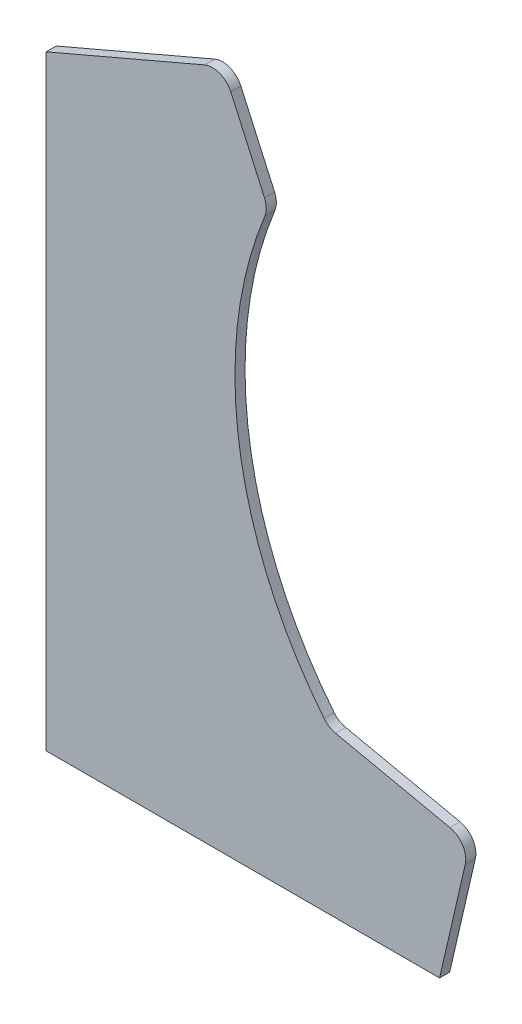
from build123d import *

# Parameters (mm, degrees)
SALIENTE_EXTRUIR3_DEPTH = 10


with BuildPart() as part:
    # Croquis1 → Saliente-Extruir3 (new body)
    with BuildSketch(Plane.XY):
        with BuildLine():
            Line((390, 0), (0, 0))
            Line((0, 0), (0, 600))
            Line((0, 600), (156.944365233, 667.261870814))
            ThreePointArc((156.944365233, 667.261870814), (172.083493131, 667.514463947), (183.061181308, 657.08626376))
            Line((183.061181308, 657.08626376), (216.431669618, 582.92962307))
            ThreePointArc((216.431669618, 582.92962307), (218.190009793, 575.081743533), (216.714823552, 567.175745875))
            ThreePointArc((216.714823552, 567.175745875), (191.356561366, 358.362114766), (275.449490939, 165.555078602))
            ThreePointArc((275.449490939, 165.555078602), (280.54183744, 161.062862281), (286.843759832, 158.533480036))
            Line((286.843759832, 158.533480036), (400.13437653, 134.256919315))
            ThreePointArc((400.13437653, 134.256919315), (412.819999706, 125.433704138), (415.431618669, 110.2036809))
            Line((415.431618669, 110.2036809), (390, 0))
        make_face()
    extrude(amount=SALIENTE_EXTRUIR3_DEPTH)


solid = part.part
